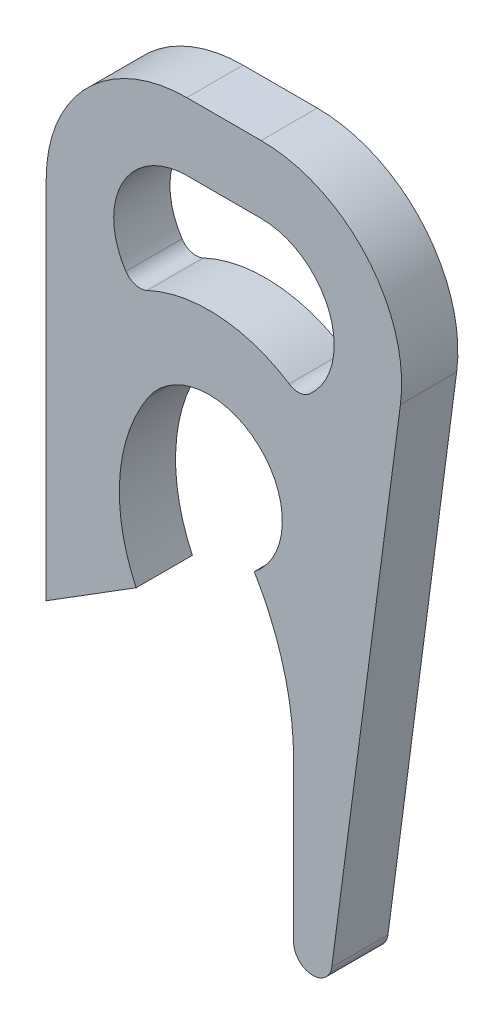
from build123d import *

# Parameters (mm, degrees)
BOSS_EXTRU_1_DEPTH      = 5
ENL_V_MAT_EXTRU_1_DEPTH = 56.217738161


with BuildPart() as part:
    # Esquisse1 → Boss.-Extru.1 (new body)
    with BuildSketch(Plane.XY):
        with BuildLine():
            Line((0, 0), (0, 32.5))
            ThreePointArc((0, 32.5), (3.661165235, 41.338834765), (12.5, 45))
            Line((12.5, 45), (19.106939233, 45))
            ThreePointArc((19.106939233, 45), (28.504936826, 40.741822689), (31.5, 30.868422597))
            Line((31.5, 30.868422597), (25.393034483, -15.518585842))
            ThreePointArc((25.393034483, -15.518585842), (23.592371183, -16.996352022), (22, -15.296194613))
            Line((22, -15.296194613), (22, -1.257350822))
            ThreePointArc((22, -1.257350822), (21.109126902, 5.357027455), (18.5, 11.5))
            ThreePointArc((18.5, 11.5), (18.905992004, 21.394041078), (9.074980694, 20.207409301))
            ThreePointArc((9.074980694, 20.207409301), (6.538580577, 12.745003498), (8, 5))
            Line((8, 5), (0, 0))
        make_face()
    extrude(amount=BOSS_EXTRU_1_DEPTH)

    # Esquisse2 → Enl_v. mat.-Extru.1 (cut, through all)
    with BuildSketch(Plane.XY.offset(5)):
        with BuildLine():
            Line((12.5, 39), (19.106939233, 39))
            ThreePointArc((19.106939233, 39), (25.183876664, 34.806692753), (23.420055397, 27.63717891))
            ThreePointArc((23.420055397, 27.63717891), (22.534830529, 27.263415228), (21.604420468, 27.503539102))
            ThreePointArc((21.604420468, 27.503539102), (15.400224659, 29.588140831), (8.966613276, 28.385537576))
            ThreePointArc((8.966613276, 28.385537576), (7.923171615, 28.298995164), (7.077316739, 28.916076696))
            ThreePointArc((7.077316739, 28.916076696), (6.775251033, 35.578514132), (12.5, 39))
        make_face()
    extrude(amount=-ENL_V_MAT_EXTRU_1_DEPTH, mode=Mode.SUBTRACT)


solid = part.part
